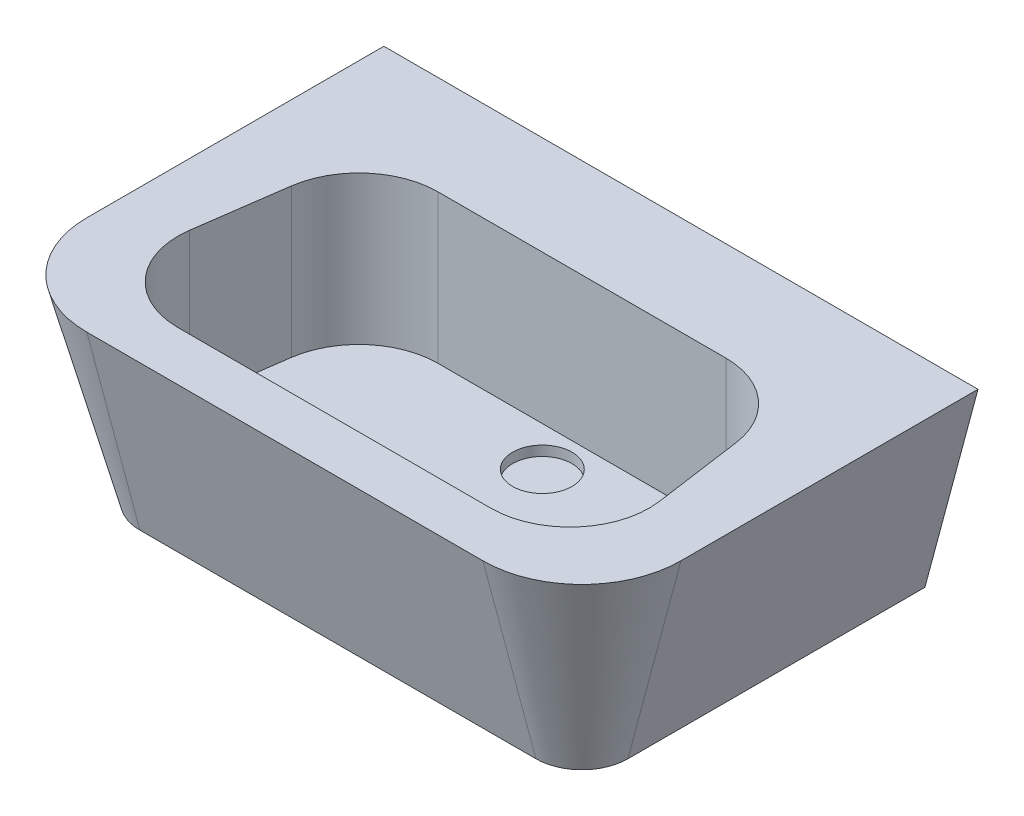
ISO-10303-21;
HEADER;
FILE_DESCRIPTION(('STEP AP214'),'2;1');
FILE_NAME('part.step','',(''),(''),'','','');
FILE_SCHEMA(('AUTOMOTIVE_DESIGN { 1 0 10303 214 1 1 1 1 }'));
ENDSEC;
DATA;
#1=APPLICATION_CONTEXT('core data for automotive mechanical design processes');
#2=APPLICATION_PROTOCOL_DEFINITION('international standard','automotive_design',2000,#1);
#3=PRODUCT_CONTEXT('',#1,'mechanical');
#4=PRODUCT('Part','Part','',(#3));
#5=PRODUCT_RELATED_PRODUCT_CATEGORY('part','',(#4));
#6=PRODUCT_DEFINITION_FORMATION('','',#4);
#7=PRODUCT_DEFINITION_CONTEXT('part definition',#1,'design');
#8=PRODUCT_DEFINITION('design','',#6,#7);
#9=PRODUCT_DEFINITION_SHAPE('','',#8);
#10=(LENGTH_UNIT() NAMED_UNIT(*) SI_UNIT(.MILLI.,.METRE.));
#11=(NAMED_UNIT(*) PLANE_ANGLE_UNIT() SI_UNIT($,.RADIAN.));
#12=(NAMED_UNIT(*) SI_UNIT($,.STERADIAN.) SOLID_ANGLE_UNIT());
#13=UNCERTAINTY_MEASURE_WITH_UNIT(LENGTH_MEASURE(1.E-05),#10,'distance_accuracy_value','');
#14=(GEOMETRIC_REPRESENTATION_CONTEXT(3) GLOBAL_UNCERTAINTY_ASSIGNED_CONTEXT((#13)) GLOBAL_UNIT_ASSIGNED_CONTEXT((#10,
#11,#12)) REPRESENTATION_CONTEXT('',''));
#15=CARTESIAN_POINT('',(0.,0.,0.));
#16=DIRECTION('',(0.,0.,1.));
#17=DIRECTION('',(1.,0.,0.));
#18=AXIS2_PLACEMENT_3D('',#15,#16,#17);
#19=CARTESIAN_POINT('',(0.,200.,0.));
#20=DIRECTION('',(-0.965925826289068,-0.258819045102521,0.));
#21=DIRECTION('',(0.258819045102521,-0.965925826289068,0.));
#22=AXIS2_PLACEMENT_3D('',#19,#20,#21);
#23=PLANE('',#22);
#24=DIRECTION('',(0.,0.,-1.));
#25=VECTOR('',#24,1.);
#26=CARTESIAN_POINT('',(53.5898384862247,0.,0.));
#27=LINE('',#26,#25);
#28=CARTESIAN_POINT('',(53.5898384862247,0.,-400.));
#29=VERTEX_POINT('',#28);
#30=CARTESIAN_POINT('',(53.5898384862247,0.,-100.));
#31=VERTEX_POINT('',#30);
#32=EDGE_CURVE('E187',#29,#31,#27,.F.);
#33=ORIENTED_EDGE('',*,*,#32,.T.);
#34=DIRECTION('',(-0.258819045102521,0.965925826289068,0.));
#35=VECTOR('',#34,1.);
#36=CARTESIAN_POINT('',(0.,200.,-100.));
#37=LINE('',#36,#35);
#38=CARTESIAN_POINT('',(0.,200.,-100.));
#39=VERTEX_POINT('',#38);
#40=EDGE_CURVE('E180',#31,#39,#37,.T.);
#41=ORIENTED_EDGE('',*,*,#40,.T.);
#42=DIRECTION('',(0.,0.,1.));
#43=VECTOR('',#42,1.);
#44=CARTESIAN_POINT('',(0.,200.,0.));
#45=LINE('',#44,#43);
#46=CARTESIAN_POINT('',(0.,200.,-400.));
#47=VERTEX_POINT('',#46);
#48=EDGE_CURVE('E225',#47,#39,#45,.T.);
#49=ORIENTED_EDGE('',*,*,#48,.F.);
#50=DIRECTION('',(-0.258819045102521,0.965925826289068,0.));
#51=VECTOR('',#50,1.);
#52=CARTESIAN_POINT('',(0.,200.,-400.));
#53=LINE('',#52,#51);
#54=EDGE_CURVE('E191',#47,#29,#53,.F.);
#55=ORIENTED_EDGE('',*,*,#54,.T.);
#56=EDGE_LOOP('',(#33,#41,#49,#55));
#57=FACE_BOUND('',#56,.T.);
#58=ADVANCED_FACE('F34',(#57),#23,.T.);
#59=CARTESIAN_POINT('',(0.,200.,0.));
#60=DIRECTION('',(0.,-0.258819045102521,0.965925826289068));
#61=DIRECTION('',(0.,-0.965925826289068,-0.258819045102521));
#62=AXIS2_PLACEMENT_3D('',#59,#60,#61);
#63=PLANE('',#62);
#64=DIRECTION('',(-1.,0.,0.));
#65=VECTOR('',#64,1.);
#66=CARTESIAN_POINT('',(0.,0.,-53.5898384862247));
#67=LINE('',#66,#65);
#68=CARTESIAN_POINT('',(100.,0.,-53.5898384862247));
#69=VERTEX_POINT('',#68);
#70=CARTESIAN_POINT('',(500.,0.,-53.5898384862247));
#71=VERTEX_POINT('',#70);
#72=EDGE_CURVE('E189',#69,#71,#67,.F.);
#73=ORIENTED_EDGE('',*,*,#72,.T.);
#74=DIRECTION('',(0.,0.965925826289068,0.258819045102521));
#75=VECTOR('',#74,1.);
#76=CARTESIAN_POINT('',(500.,200.,0.));
#77=LINE('',#76,#75);
#78=CARTESIAN_POINT('',(500.,200.,0.));
#79=VERTEX_POINT('',#78);
#80=EDGE_CURVE('E183',#71,#79,#77,.T.);
#81=ORIENTED_EDGE('',*,*,#80,.T.);
#82=DIRECTION('',(1.,0.,0.));
#83=VECTOR('',#82,1.);
#84=CARTESIAN_POINT('',(0.,200.,0.));
#85=LINE('',#84,#83);
#86=CARTESIAN_POINT('',(100.,200.,0.));
#87=VERTEX_POINT('',#86);
#88=EDGE_CURVE('E208',#87,#79,#85,.T.);
#89=ORIENTED_EDGE('',*,*,#88,.F.);
#90=DIRECTION('',(0.,0.965925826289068,0.258819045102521));
#91=VECTOR('',#90,1.);
#92=CARTESIAN_POINT('',(100.,200.,0.));
#93=LINE('',#92,#91);
#94=EDGE_CURVE('E186',#87,#69,#93,.F.);
#95=ORIENTED_EDGE('',*,*,#94,.T.);
#96=EDGE_LOOP('',(#73,#81,#89,#95));
#97=FACE_BOUND('',#96,.T.);
#98=ADVANCED_FACE('F36',(#97),#63,.T.);
#99=CARTESIAN_POINT('',(600.,200.,0.));
#100=DIRECTION('',(0.965925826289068,-0.258819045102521,0.));
#101=DIRECTION('',(0.258819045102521,0.965925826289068,0.));
#102=AXIS2_PLACEMENT_3D('',#99,#100,#101);
#103=PLANE('',#102);
#104=DIRECTION('',(0.,0.,-1.));
#105=VECTOR('',#104,1.);
#106=CARTESIAN_POINT('',(600.,200.,0.));
#107=LINE('',#106,#105);
#108=CARTESIAN_POINT('',(600.,200.,-100.));
#109=VERTEX_POINT('',#108);
#110=CARTESIAN_POINT('',(600.,200.,-400.));
#111=VERTEX_POINT('',#110);
#112=EDGE_CURVE('E220',#109,#111,#107,.T.);
#113=ORIENTED_EDGE('',*,*,#112,.F.);
#114=DIRECTION('',(0.258819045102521,0.965925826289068,0.));
#115=VECTOR('',#114,1.);
#116=CARTESIAN_POINT('',(600.,200.,-100.));
#117=LINE('',#116,#115);
#118=CARTESIAN_POINT('',(546.410161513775,0.,-100.));
#119=VERTEX_POINT('',#118);
#120=EDGE_CURVE('E38',#109,#119,#117,.F.);
#121=ORIENTED_EDGE('',*,*,#120,.T.);
#122=DIRECTION('',(0.,0.,1.));
#123=VECTOR('',#122,1.);
#124=CARTESIAN_POINT('',(546.410161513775,0.,-1.51659285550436E-13));
#125=LINE('',#124,#123);
#126=CARTESIAN_POINT('',(546.410161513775,0.,-400.));
#127=VERTEX_POINT('',#126);
#128=EDGE_CURVE('E198',#119,#127,#125,.F.);
#129=ORIENTED_EDGE('',*,*,#128,.T.);
#130=DIRECTION('',(0.258819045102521,0.965925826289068,0.));
#131=VECTOR('',#130,1.);
#132=CARTESIAN_POINT('',(559.807621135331,49.9999999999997,-400.));
#133=LINE('',#132,#131);
#134=EDGE_CURVE('E194',#111,#127,#133,.F.);
#135=ORIENTED_EDGE('',*,*,#134,.F.);
#136=EDGE_LOOP('',(#113,#121,#129,#135));
#137=FACE_BOUND('',#136,.T.);
#138=ADVANCED_FACE('F218',(#137),#103,.T.);
#139=CARTESIAN_POINT('',(0.,200.,-400.));
#140=DIRECTION('',(0.,0.,1.));
#141=DIRECTION('',(1.,0.,0.));
#142=AXIS2_PLACEMENT_3D('',#139,#140,#141);
#143=PLANE('',#142);
#144=DIRECTION('',(-1.,0.,0.));
#145=VECTOR('',#144,1.);
#146=CARTESIAN_POINT('',(0.,0.,-400.));
#147=LINE('',#146,#145);
#148=EDGE_CURVE('E200',#127,#29,#147,.T.);
#149=ORIENTED_EDGE('',*,*,#148,.T.);
#150=ORIENTED_EDGE('',*,*,#54,.F.);
#151=DIRECTION('',(-1.,0.,0.));
#152=VECTOR('',#151,1.);
#153=CARTESIAN_POINT('',(0.,200.,-400.));
#154=LINE('',#153,#152);
#155=EDGE_CURVE('E195',#111,#47,#154,.T.);
#156=ORIENTED_EDGE('',*,*,#155,.F.);
#157=ORIENTED_EDGE('',*,*,#134,.T.);
#158=EDGE_LOOP('',(#149,#150,#156,#157));
#159=FACE_BOUND('',#158,.T.);
#160=ADVANCED_FACE('F275',(#159),#143,.F.);
#161=CARTESIAN_POINT('',(0.,200.,0.));
#162=DIRECTION('',(0.,-1.,0.));
#163=DIRECTION('',(0.,0.,-1.));
#164=AXIS2_PLACEMENT_3D('',#161,#162,#163);
#165=PLANE('',#164);
#166=DIRECTION('',(-1.,0.,0.));
#167=VECTOR('',#166,1.);
#168=CARTESIAN_POINT('',(85.1352086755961,200.,-300.));
#169=LINE('',#168,#167);
#170=CARTESIAN_POINT('',(445.321852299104,200.,-300.));
#171=VERTEX_POINT('',#170);
#172=CARTESIAN_POINT('',(154.678147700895,200.,-300.));
#173=VERTEX_POINT('',#172);
#174=EDGE_CURVE('E163',#171,#173,#169,.T.);
#175=ORIENTED_EDGE('',*,*,#174,.F.);
#176=CARTESIAN_POINT('',(445.321852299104,200.,-220.));
#177=DIRECTION('',(0.,-1.,0.));
#178=DIRECTION('',(0.,0.,-1.));
#179=AXIS2_PLACEMENT_3D('',#176,#177,#178);
#180=CIRCLE('',#179,80.);
#181=CARTESIAN_POINT('',(524.54329779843,200.,-231.133848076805));
#182=VERTEX_POINT('',#181);
#183=EDGE_CURVE('E44',#171,#182,#180,.T.);
#184=ORIENTED_EDGE('',*,*,#183,.T.);
#185=DIRECTION('',(-0.139173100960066,0.,-0.99026806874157));
#186=VECTOR('',#185,1.);
#187=CARTESIAN_POINT('',(550.,200.,-50.));
#188=LINE('',#187,#186);
#189=CARTESIAN_POINT('',(537.191972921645,200.,-141.133848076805));
#190=VERTEX_POINT('',#189);
#191=EDGE_CURVE('E264',#190,#182,#188,.T.);
#192=ORIENTED_EDGE('',*,*,#191,.F.);
#193=CARTESIAN_POINT('',(457.970527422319,200.,-130.));
#194=DIRECTION('',(0.,-1.,0.));
#195=DIRECTION('',(0.,0.,-1.));
#196=AXIS2_PLACEMENT_3D('',#193,#194,#195);
#197=CIRCLE('',#196,80.);
#198=CARTESIAN_POINT('',(457.970527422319,200.,-50.));
#199=VERTEX_POINT('',#198);
#200=EDGE_CURVE('E153',#190,#199,#197,.T.);
#201=ORIENTED_EDGE('',*,*,#200,.T.);
#202=DIRECTION('',(1.,0.,0.));
#203=VECTOR('',#202,1.);
#204=CARTESIAN_POINT('',(50.,200.,-50.));
#205=LINE('',#204,#203);
#206=CARTESIAN_POINT('',(142.02947257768,200.,-50.));
#207=VERTEX_POINT('',#206);
#208=EDGE_CURVE('E148',#207,#199,#205,.T.);
#209=ORIENTED_EDGE('',*,*,#208,.F.);
#210=CARTESIAN_POINT('',(142.02947257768,200.,-130.));
#211=DIRECTION('',(0.,-1.,0.));
#212=DIRECTION('',(0.,0.,-1.));
#213=AXIS2_PLACEMENT_3D('',#210,#211,#212);
#214=CIRCLE('',#213,80.);
#215=CARTESIAN_POINT('',(62.8080270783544,200.,-141.133848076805));
#216=VERTEX_POINT('',#215);
#217=EDGE_CURVE('E143',#207,#216,#214,.T.);
#218=ORIENTED_EDGE('',*,*,#217,.T.);
#219=DIRECTION('',(-0.139173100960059,0.,0.990268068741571));
#220=VECTOR('',#219,1.);
#221=CARTESIAN_POINT('',(50.,200.,-50.));
#222=LINE('',#221,#220);
#223=CARTESIAN_POINT('',(75.456702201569,200.,-231.133848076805));
#224=VERTEX_POINT('',#223);
#225=EDGE_CURVE('E146',#224,#216,#222,.T.);
#226=ORIENTED_EDGE('',*,*,#225,.F.);
#227=CARTESIAN_POINT('',(154.678147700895,200.,-220.));
#228=DIRECTION('',(0.,-1.,0.));
#229=DIRECTION('',(0.,0.,-1.));
#230=AXIS2_PLACEMENT_3D('',#227,#228,#229);
#231=CIRCLE('',#230,80.);
#232=EDGE_CURVE('E11',#224,#173,#231,.T.);
#233=ORIENTED_EDGE('',*,*,#232,.T.);
#234=EDGE_LOOP('',(#175,#184,#192,#201,#209,#218,#226,#233));
#235=FACE_BOUND('',#234,.T.);
#236=ORIENTED_EDGE('',*,*,#88,.T.);
#237=CARTESIAN_POINT('',(500.,200.,-100.));
#238=DIRECTION('',(0.,-1.,0.));
#239=DIRECTION('',(0.,0.,-1.));
#240=AXIS2_PLACEMENT_3D('',#237,#238,#239);
#241=CIRCLE('',#240,100.);
#242=EDGE_CURVE('E91',#79,#109,#241,.F.);
#243=ORIENTED_EDGE('',*,*,#242,.T.);
#244=ORIENTED_EDGE('',*,*,#112,.T.);
#245=ORIENTED_EDGE('',*,*,#155,.T.);
#246=ORIENTED_EDGE('',*,*,#48,.T.);
#247=CARTESIAN_POINT('',(100.,200.,-100.));
#248=DIRECTION('',(0.,-1.,0.));
#249=DIRECTION('',(0.,0.,-1.));
#250=AXIS2_PLACEMENT_3D('',#247,#248,#249);
#251=CIRCLE('',#250,100.);
#252=EDGE_CURVE('E185',#39,#87,#251,.F.);
#253=ORIENTED_EDGE('',*,*,#252,.T.);
#254=EDGE_LOOP('',(#236,#243,#244,#245,#246,#253));
#255=FACE_BOUND('',#254,.T.);
#256=ADVANCED_FACE('F145',(#235,#255),#165,.F.);
#257=CARTESIAN_POINT('',(0.,0.,0.));
#258=DIRECTION('',(0.,-1.,0.));
#259=DIRECTION('',(0.,0.,-1.));
#260=AXIS2_PLACEMENT_3D('',#257,#258,#259);
#261=PLANE('',#260);
#262=ORIENTED_EDGE('',*,*,#128,.F.);
#263=CARTESIAN_POINT('',(500.,0.,-100.));
#264=DIRECTION('',(0.,-1.,0.));
#265=DIRECTION('',(0.,0.,-1.));
#266=AXIS2_PLACEMENT_3D('',#263,#264,#265);
#267=CIRCLE('',#266,46.4101615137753);
#268=EDGE_CURVE('E201',#119,#71,#267,.T.);
#269=ORIENTED_EDGE('',*,*,#268,.T.);
#270=ORIENTED_EDGE('',*,*,#72,.F.);
#271=CARTESIAN_POINT('',(100.,0.,-100.));
#272=DIRECTION('',(0.,-1.,0.));
#273=DIRECTION('',(0.,0.,-1.));
#274=AXIS2_PLACEMENT_3D('',#271,#272,#273);
#275=CIRCLE('',#274,46.4101615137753);
#276=EDGE_CURVE('E79',#69,#31,#275,.T.);
#277=ORIENTED_EDGE('',*,*,#276,.T.);
#278=ORIENTED_EDGE('',*,*,#32,.F.);
#279=ORIENTED_EDGE('',*,*,#148,.F.);
#280=EDGE_LOOP('',(#262,#269,#270,#277,#278,#279));
#281=FACE_BOUND('',#280,.T.);
#282=ADVANCED_FACE('F211',(#281),#261,.T.);
#283=CARTESIAN_POINT('',(500.,200.,-100.));
#284=DIRECTION('',(0.,1.,0.));
#285=DIRECTION('',(0.,0.,-1.));
#286=AXIS2_PLACEMENT_3D('',#283,#284,#285);
#287=CONICAL_SURFACE('',#286,100.,0.26179938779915);
#288=ORIENTED_EDGE('',*,*,#242,.F.);
#289=ORIENTED_EDGE('',*,*,#80,.F.);
#290=ORIENTED_EDGE('',*,*,#268,.F.);
#291=ORIENTED_EDGE('',*,*,#120,.F.);
#292=EDGE_LOOP('',(#288,#289,#290,#291));
#293=FACE_BOUND('',#292,.T.);
#294=ADVANCED_FACE('F216',(#293),#287,.T.);
#295=CARTESIAN_POINT('',(100.,200.,-100.));
#296=DIRECTION('',(0.,1.,0.));
#297=DIRECTION('',(0.,0.,-1.));
#298=AXIS2_PLACEMENT_3D('',#295,#296,#297);
#299=CONICAL_SURFACE('',#298,100.,0.26179938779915);
#300=ORIENTED_EDGE('',*,*,#252,.F.);
#301=ORIENTED_EDGE('',*,*,#40,.F.);
#302=ORIENTED_EDGE('',*,*,#276,.F.);
#303=ORIENTED_EDGE('',*,*,#94,.F.);
#304=EDGE_LOOP('',(#300,#301,#302,#303));
#305=FACE_BOUND('',#304,.T.);
#306=ADVANCED_FACE('F273',(#305),#299,.T.);
#307=CARTESIAN_POINT('',(550.,50.,-50.));
#308=DIRECTION('',(0.99026806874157,0.,-0.139173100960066));
#309=DIRECTION('',(-0.139173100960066,0.,-0.99026806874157));
#310=AXIS2_PLACEMENT_3D('',#307,#308,#309);
#311=PLANE('',#310);
#312=DIRECTION('',(-0.139173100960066,0.,-0.99026806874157));
#313=VECTOR('',#312,1.);
#314=CARTESIAN_POINT('',(550.,50.,-50.));
#315=LINE('',#314,#313);
#316=CARTESIAN_POINT('',(537.191972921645,50.,-141.133848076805));
#317=VERTEX_POINT('',#316);
#318=CARTESIAN_POINT('',(524.54329779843,50.,-231.133848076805));
#319=VERTEX_POINT('',#318);
#320=EDGE_CURVE('E250',#317,#319,#315,.T.);
#321=ORIENTED_EDGE('',*,*,#320,.F.);
#322=DIRECTION('',(0.,1.,0.));
#323=VECTOR('',#322,1.);
#324=CARTESIAN_POINT('',(537.191972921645,200.,-141.133848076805));
#325=LINE('',#324,#323);
#326=EDGE_CURVE('E233',#317,#190,#325,.T.);
#327=ORIENTED_EDGE('',*,*,#326,.T.);
#328=ORIENTED_EDGE('',*,*,#191,.T.);
#329=DIRECTION('',(0.,1.,0.));
#330=VECTOR('',#329,1.);
#331=CARTESIAN_POINT('',(524.54329779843,50.,-231.133848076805));
#332=LINE('',#331,#330);
#333=EDGE_CURVE('E182',#182,#319,#332,.F.);
#334=ORIENTED_EDGE('',*,*,#333,.T.);
#335=EDGE_LOOP('',(#321,#327,#328,#334));
#336=FACE_BOUND('',#335,.T.);
#337=ADVANCED_FACE('F257',(#336),#311,.F.);
#338=CARTESIAN_POINT('',(50.,50.,-50.));
#339=DIRECTION('',(0.,0.,1.));
#340=DIRECTION('',(1.,0.,0.));
#341=AXIS2_PLACEMENT_3D('',#338,#339,#340);
#342=PLANE('',#341);
#343=ORIENTED_EDGE('',*,*,#208,.T.);
#344=DIRECTION('',(0.,1.,0.));
#345=VECTOR('',#344,1.);
#346=CARTESIAN_POINT('',(457.970527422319,50.,-50.));
#347=LINE('',#346,#345);
#348=CARTESIAN_POINT('',(457.970527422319,50.,-50.));
#349=VERTEX_POINT('',#348);
#350=EDGE_CURVE('E238',#199,#349,#347,.F.);
#351=ORIENTED_EDGE('',*,*,#350,.T.);
#352=DIRECTION('',(1.,0.,0.));
#353=VECTOR('',#352,1.);
#354=CARTESIAN_POINT('',(50.,50.,-50.));
#355=LINE('',#354,#353);
#356=CARTESIAN_POINT('',(142.02947257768,50.,-50.));
#357=VERTEX_POINT('',#356);
#358=EDGE_CURVE('E190',#357,#349,#355,.T.);
#359=ORIENTED_EDGE('',*,*,#358,.F.);
#360=DIRECTION('',(0.,1.,0.));
#361=VECTOR('',#360,1.);
#362=CARTESIAN_POINT('',(142.02947257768,200.,-50.));
#363=LINE('',#362,#361);
#364=EDGE_CURVE('E236',#357,#207,#363,.T.);
#365=ORIENTED_EDGE('',*,*,#364,.T.);
#366=EDGE_LOOP('',(#343,#351,#359,#365));
#367=FACE_BOUND('',#366,.T.);
#368=ADVANCED_FACE('F266',(#367),#342,.F.);
#369=CARTESIAN_POINT('',(50.,50.,-50.));
#370=DIRECTION('',(-0.990268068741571,0.,-0.139173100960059));
#371=DIRECTION('',(-0.139173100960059,0.,0.990268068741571));
#372=AXIS2_PLACEMENT_3D('',#369,#370,#371);
#373=PLANE('',#372);
#374=ORIENTED_EDGE('',*,*,#225,.T.);
#375=DIRECTION('',(0.,1.,0.));
#376=VECTOR('',#375,1.);
#377=CARTESIAN_POINT('',(62.8080270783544,50.,-141.133848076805));
#378=LINE('',#377,#376);
#379=CARTESIAN_POINT('',(62.8080270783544,50.,-141.133848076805));
#380=VERTEX_POINT('',#379);
#381=EDGE_CURVE('E159',#216,#380,#378,.F.);
#382=ORIENTED_EDGE('',*,*,#381,.T.);
#383=DIRECTION('',(-0.139173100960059,0.,0.990268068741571));
#384=VECTOR('',#383,1.);
#385=CARTESIAN_POINT('',(50.,50.,-50.));
#386=LINE('',#385,#384);
#387=CARTESIAN_POINT('',(75.456702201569,50.,-231.133848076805));
#388=VERTEX_POINT('',#387);
#389=EDGE_CURVE('E448',#388,#380,#386,.T.);
#390=ORIENTED_EDGE('',*,*,#389,.F.);
#391=DIRECTION('',(0.,1.,0.));
#392=VECTOR('',#391,1.);
#393=CARTESIAN_POINT('',(75.4567022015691,200.,-231.133848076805));
#394=LINE('',#393,#392);
#395=EDGE_CURVE('E162',#388,#224,#394,.T.);
#396=ORIENTED_EDGE('',*,*,#395,.T.);
#397=EDGE_LOOP('',(#374,#382,#390,#396));
#398=FACE_BOUND('',#397,.T.);
#399=ADVANCED_FACE('F157',(#398),#373,.F.);
#400=CARTESIAN_POINT('',(85.1352086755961,50.,-300.));
#401=DIRECTION('',(0.,0.,-1.));
#402=DIRECTION('',(-1.,0.,0.));
#403=AXIS2_PLACEMENT_3D('',#400,#401,#402);
#404=PLANE('',#403);
#405=DIRECTION('',(-1.,0.,0.));
#406=VECTOR('',#405,1.);
#407=CARTESIAN_POINT('',(85.1352086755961,50.,-300.));
#408=LINE('',#407,#406);
#409=CARTESIAN_POINT('',(445.321852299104,50.,-300.));
#410=VERTEX_POINT('',#409);
#411=CARTESIAN_POINT('',(154.678147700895,50.,-300.));
#412=VERTEX_POINT('',#411);
#413=EDGE_CURVE('E261',#410,#412,#408,.T.);
#414=ORIENTED_EDGE('',*,*,#413,.F.);
#415=DIRECTION('',(0.,1.,0.));
#416=VECTOR('',#415,1.);
#417=CARTESIAN_POINT('',(445.321852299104,200.,-300.));
#418=LINE('',#417,#416);
#419=EDGE_CURVE('E170',#410,#171,#418,.T.);
#420=ORIENTED_EDGE('',*,*,#419,.T.);
#421=ORIENTED_EDGE('',*,*,#174,.T.);
#422=DIRECTION('',(0.,1.,0.));
#423=VECTOR('',#422,1.);
#424=CARTESIAN_POINT('',(154.678147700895,50.,-300.));
#425=LINE('',#424,#423);
#426=EDGE_CURVE('E168',#173,#412,#425,.F.);
#427=ORIENTED_EDGE('',*,*,#426,.T.);
#428=EDGE_LOOP('',(#414,#420,#421,#427));
#429=FACE_BOUND('',#428,.T.);
#430=ADVANCED_FACE('F306',(#429),#404,.F.);
#431=CARTESIAN_POINT('',(0.,50.,0.));
#432=DIRECTION('',(0.,-1.,0.));
#433=DIRECTION('',(0.,0.,-1.));
#434=AXIS2_PLACEMENT_3D('',#431,#432,#433);
#435=PLANE('',#434);
#436=CARTESIAN_POINT('',(300.,50.,-260.));
#437=DIRECTION('',(0.,1.,0.));
#438=DIRECTION('',(0.,0.,1.));
#439=AXIS2_PLACEMENT_3D('',#436,#437,#438);
#440=CIRCLE('',#439,30.);
#441=CARTESIAN_POINT('',(300.,50.,-230.));
#442=VERTEX_POINT('',#441);
#443=EDGE_CURVE('E440',#442,#442,#440,.T.);
#444=ORIENTED_EDGE('',*,*,#443,.F.);
#445=EDGE_LOOP('',(#444));
#446=FACE_BOUND('',#445,.T.);
#447=ORIENTED_EDGE('',*,*,#358,.T.);
#448=CARTESIAN_POINT('',(457.970527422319,50.,-130.));
#449=DIRECTION('',(0.,-1.,0.));
#450=DIRECTION('',(0.,0.,-1.));
#451=AXIS2_PLACEMENT_3D('',#448,#449,#450);
#452=CIRCLE('',#451,80.);
#453=EDGE_CURVE('E172',#349,#317,#452,.F.);
#454=ORIENTED_EDGE('',*,*,#453,.T.);
#455=ORIENTED_EDGE('',*,*,#320,.T.);
#456=CARTESIAN_POINT('',(445.321852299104,50.,-220.));
#457=DIRECTION('',(0.,-1.,0.));
#458=DIRECTION('',(0.,0.,-1.));
#459=AXIS2_PLACEMENT_3D('',#456,#457,#458);
#460=CIRCLE('',#459,80.);
#461=EDGE_CURVE('E242',#319,#410,#460,.F.);
#462=ORIENTED_EDGE('',*,*,#461,.T.);
#463=ORIENTED_EDGE('',*,*,#413,.T.);
#464=CARTESIAN_POINT('',(154.678147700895,50.,-220.));
#465=DIRECTION('',(0.,-1.,0.));
#466=DIRECTION('',(0.,0.,-1.));
#467=AXIS2_PLACEMENT_3D('',#464,#465,#466);
#468=CIRCLE('',#467,80.);
#469=EDGE_CURVE('E240',#412,#388,#468,.F.);
#470=ORIENTED_EDGE('',*,*,#469,.T.);
#471=ORIENTED_EDGE('',*,*,#389,.T.);
#472=CARTESIAN_POINT('',(142.02947257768,50.,-130.));
#473=DIRECTION('',(0.,-1.,0.));
#474=DIRECTION('',(0.,0.,-1.));
#475=AXIS2_PLACEMENT_3D('',#472,#473,#474);
#476=CIRCLE('',#475,80.);
#477=EDGE_CURVE('E167',#380,#357,#476,.F.);
#478=ORIENTED_EDGE('',*,*,#477,.T.);
#479=EDGE_LOOP('',(#447,#454,#455,#462,#463,#470,#471,#478));
#480=FACE_BOUND('',#479,.T.);
#481=ADVANCED_FACE('F249',(#446,#480),#435,.F.);
#482=CARTESIAN_POINT('',(457.970527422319,50.,-130.));
#483=DIRECTION('',(0.,-1.,0.));
#484=DIRECTION('',(0.,0.,-1.));
#485=AXIS2_PLACEMENT_3D('',#482,#483,#484);
#486=CYLINDRICAL_SURFACE('',#485,80.);
#487=ORIENTED_EDGE('',*,*,#453,.F.);
#488=ORIENTED_EDGE('',*,*,#350,.F.);
#489=ORIENTED_EDGE('',*,*,#200,.F.);
#490=ORIENTED_EDGE('',*,*,#326,.F.);
#491=EDGE_LOOP('',(#487,#488,#489,#490));
#492=FACE_BOUND('',#491,.T.);
#493=ADVANCED_FACE('F263',(#492),#486,.F.);
#494=CARTESIAN_POINT('',(142.02947257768,50.,-130.));
#495=DIRECTION('',(0.,-1.,0.));
#496=DIRECTION('',(0.,0.,-1.));
#497=AXIS2_PLACEMENT_3D('',#494,#495,#496);
#498=CYLINDRICAL_SURFACE('',#497,80.);
#499=ORIENTED_EDGE('',*,*,#477,.F.);
#500=ORIENTED_EDGE('',*,*,#381,.F.);
#501=ORIENTED_EDGE('',*,*,#217,.F.);
#502=ORIENTED_EDGE('',*,*,#364,.F.);
#503=EDGE_LOOP('',(#499,#500,#501,#502));
#504=FACE_BOUND('',#503,.T.);
#505=ADVANCED_FACE('F166',(#504),#498,.F.);
#506=CARTESIAN_POINT('',(445.321852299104,50.,-220.));
#507=DIRECTION('',(0.,-1.,0.));
#508=DIRECTION('',(0.,0.,-1.));
#509=AXIS2_PLACEMENT_3D('',#506,#507,#508);
#510=CYLINDRICAL_SURFACE('',#509,80.);
#511=ORIENTED_EDGE('',*,*,#461,.F.);
#512=ORIENTED_EDGE('',*,*,#333,.F.);
#513=ORIENTED_EDGE('',*,*,#183,.F.);
#514=ORIENTED_EDGE('',*,*,#419,.F.);
#515=EDGE_LOOP('',(#511,#512,#513,#514));
#516=FACE_BOUND('',#515,.T.);
#517=ADVANCED_FACE('F369',(#516),#510,.F.);
#518=CARTESIAN_POINT('',(154.678147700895,50.,-220.));
#519=DIRECTION('',(0.,-1.,0.));
#520=DIRECTION('',(0.,0.,-1.));
#521=AXIS2_PLACEMENT_3D('',#518,#519,#520);
#522=CYLINDRICAL_SURFACE('',#521,80.);
#523=ORIENTED_EDGE('',*,*,#469,.F.);
#524=ORIENTED_EDGE('',*,*,#426,.F.);
#525=ORIENTED_EDGE('',*,*,#232,.F.);
#526=ORIENTED_EDGE('',*,*,#395,.F.);
#527=EDGE_LOOP('',(#523,#524,#525,#526));
#528=FACE_BOUND('',#527,.T.);
#529=ADVANCED_FACE('F292',(#528),#522,.F.);
#530=CARTESIAN_POINT('',(300.,40.,-260.));
#531=DIRECTION('',(0.,1.,0.));
#532=DIRECTION('',(0.,0.,1.));
#533=AXIS2_PLACEMENT_3D('',#530,#531,#532);
#534=CYLINDRICAL_SURFACE('',#533,30.);
#535=CARTESIAN_POINT('',(300.,40.,-260.));
#536=DIRECTION('',(0.,1.,0.));
#537=DIRECTION('',(0.,0.,1.));
#538=AXIS2_PLACEMENT_3D('',#535,#536,#537);
#539=CIRCLE('',#538,30.);
#540=CARTESIAN_POINT('',(300.,40.,-230.));
#541=VERTEX_POINT('',#540);
#542=EDGE_CURVE('E439',#541,#541,#539,.T.);
#543=ORIENTED_EDGE('',*,*,#542,.F.);
#544=EDGE_LOOP('',(#543));
#545=FACE_BOUND('',#544,.T.);
#546=ORIENTED_EDGE('',*,*,#443,.T.);
#547=EDGE_LOOP('',(#546));
#548=FACE_BOUND('',#547,.T.);
#549=ADVANCED_FACE('F383',(#545,#548),#534,.F.);
#550=CARTESIAN_POINT('',(300.,40.,-260.));
#551=DIRECTION('',(0.,1.,0.));
#552=DIRECTION('',(0.,0.,1.));
#553=AXIS2_PLACEMENT_3D('',#550,#551,#552);
#554=PLANE('',#553);
#555=ORIENTED_EDGE('',*,*,#542,.T.);
#556=EDGE_LOOP('',(#555));
#557=FACE_BOUND('',#556,.T.);
#558=ADVANCED_FACE('F390',(#557),#554,.T.);
#559=CLOSED_SHELL('',(#58,#98,#138,#160,#256,#282,#294,#306,#337,#368,#399,#430,#481,#493,#505,
#517,#529,#549,#558));
#560=MANIFOLD_SOLID_BREP('B2',#559);
#561=ADVANCED_BREP_SHAPE_REPRESENTATION('',(#18,#560),#14);
#562=SHAPE_DEFINITION_REPRESENTATION(#9,#561);
ENDSEC;
END-ISO-10303-21;
